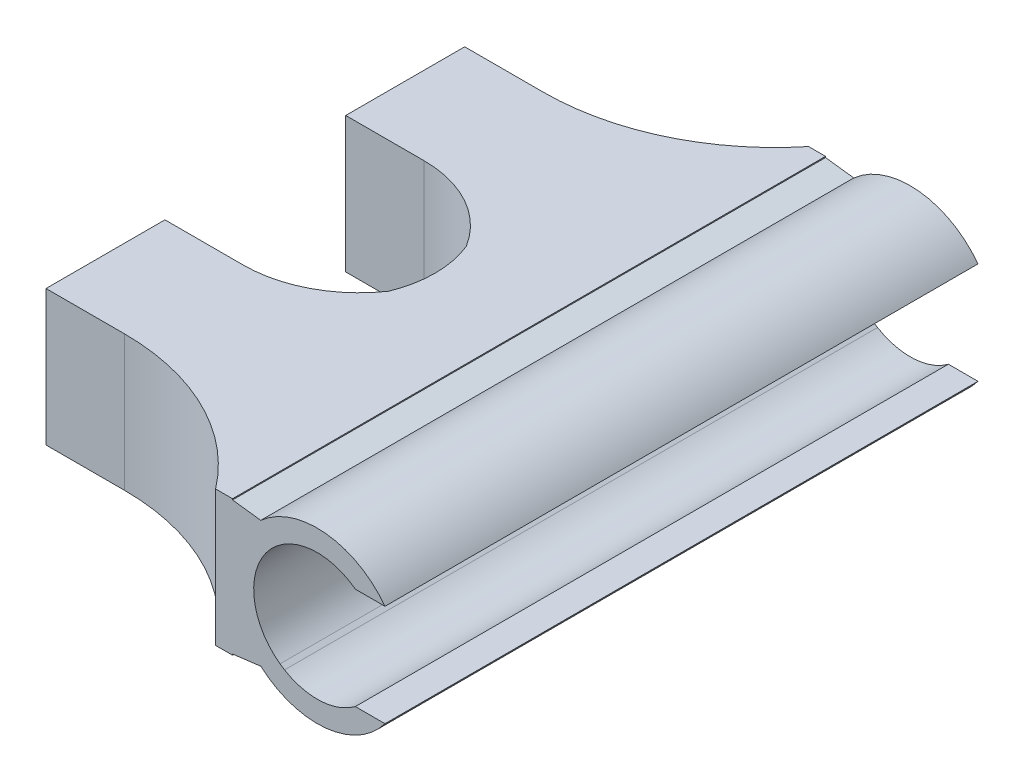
from build123d import *

# Parameters (mm, degrees)
SALIENTE_EXTRUIR1_DEPTH = 70
SALIENTE_EXTRUIR3_DEPTH = 16
SALIENTE_EXTRUIR4_DEPTH = 70
CROQUIS9_W              = 7
CROQUIS9_H              = 14.04
CROQUIS9_W_2            = 6.999998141
CORTAR_EXTRUIR1_DEPTH   = 16
CROQUIS10_W             = 5
CROQUIS10_H             = 14.04
CORTAR_EXTRUIR2_DEPTH   = 16


with BuildPart() as part:
    # Croquis2 → Saliente-Extruir1 (new body)
    with BuildSketch(Plane.XY):
        with BuildLine():
            Line((4.495782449, -6), (7.995782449, -6))
            ThreePointArc((7.995782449, -6), (-10.004217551, 0), (7.995782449, 6))
            Line((7.995782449, 6), (4.495782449, 6))
            ThreePointArc((4.495782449, 6), (-7.504217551, 0), (4.495782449, -6))
        make_face()
    extrude(amount=SALIENTE_EXTRUIR1_DEPTH)



with BuildPart() as body_2:
    # Croquis4 → Saliente-Extruir3 (new body)
    with BuildSketch(Plane(origin=(0, 8, 0), x_dir=(-1, 0, 0), z_dir=(0, -1, 0))):
        with BuildLine():
            Line((54.500001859, -17.5), (54.500001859, -24.14))
            Line((54.500001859, -24.14), (44.480001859, -24.14))
            Line((44.480001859, -24.14), (33.25000093, -24.14))
            ThreePointArc((33.25000093, -24.14), (26.809279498, -25.814667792), (21.999999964, -30.414475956))
            ThreePointArc((21.999999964, -30.414475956), (21.101356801, -35.000000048), (22, -39.585524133))
            ThreePointArc((22, -39.585524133), (26.899659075, -43.917124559), (33.25000093, -45.48))
            Line((33.25000093, -45.48), (44.48, -45.48))
            Line((44.48, -45.48), (54.5, -45.48))
            Line((54.5, -45.48), (54.5, -52.5))
            Line((54.5, -52.5), (54.5, -59.52))
            Line((54.5, -59.52), (44.48, -59.52))
            Line((44.48, -59.52), (33.25000093, -59.52))
            ThreePointArc((33.25000093, -59.52), (21.403134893, -62.282457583), (12, -70))
            Line((12, -70), (10, -70))
            Line((10, -70), (10, 0))
            Line((10, 0), (12, 0))
            ThreePointArc((12, 0), (21.485939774, -7.446538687), (33.25000093, -10.1))
            Line((33.25000093, -10.1), (44.558385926, -10.1))
            Line((44.558385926, -10.1), (54.500001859, -10.1))
            Line((54.500001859, -10.1), (54.500001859, -17.5))
        make_face()
    extrude(amount=SALIENTE_EXTRUIR3_DEPTH)


with BuildPart() as part_1:
    add(part.part)

    add(body_2.part)  # Saliente-Extruir4 merges body 2
    # Croquis8 → Saliente-Extruir4 (add)
    with BuildSketch(Plane.XY.offset(70)):
        Polygon((-11, 8), (-11, -8), (-3, -7), (-7, -4.363124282), (-10.004217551, 0), (-7, 4.567022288), (-3, 7), align=None)
    extrude(amount=-SALIENTE_EXTRUIR4_DEPTH)

    # Croquis9 → Cortar-Extruir1 (cut)
    with BuildSketch(Plane(origin=(0, 8, 0), x_dir=(1, 0, 0), z_dir=(0, 1, 0))):
        with Locations((-51.000001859, -17.12)):
            Rectangle(CROQUIS9_W, CROQUIS9_H)
        with Locations((-51.00000093, -52.5)):
            Rectangle(CROQUIS9_W_2, CROQUIS9_H)
    extrude(amount=-CORTAR_EXTRUIR1_DEPTH, mode=Mode.SUBTRACT)

    # Croquis10 → Cortar-Extruir2 (cut)
    with BuildSketch(Plane.XZ.offset(8)):
        with Locations((-45.000001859, 52.5)):
            Rectangle(CROQUIS10_W, CROQUIS10_H)
        with Locations((-45.000001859, 17.12)):
            Rectangle(CROQUIS10_W, CROQUIS10_H)
    extrude(amount=-CORTAR_EXTRUIR2_DEPTH, mode=Mode.SUBTRACT)


solid = part_1.part
